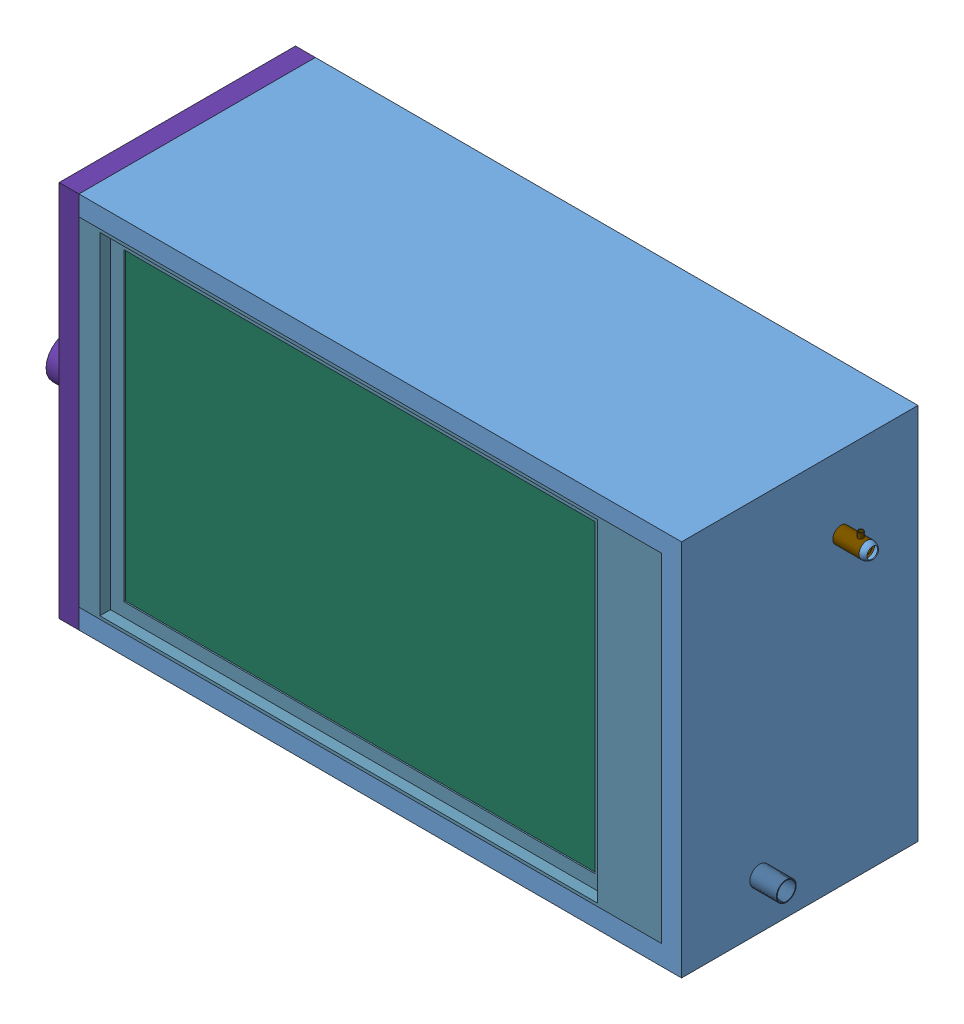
SolidWorks assembly evaporador.SLDASM, configuration Predeterminado (file format 4400). Lengths in mm.
Overall size (1320.42 723 452.5).
255 component instances, 19 part files, 44 mates.
Components (placement in the parent):
- carcasa parte enrada y salida de refrigerante-1: carcasa parte enrada y salida de refrigerante.SLDPRT [Predeterminado] at (-563.5445 -272.3645 -226.25) size (1153.5 723 452.5)
- soporte intercambiador-1: soporte intercambiador.SLDPRT [Predeterminado] at (-524.0445 -196.3645 100.2125) x (0 0 -1) z (1 0 0) size (202.5 38 1114)
- emsamble evaporador-1: emsamble evaporador.SLDASM [Predeterminado] at (-11.8465 -71.5019 257.8938) x (0 0 -1) z (1 0 0) size (185.79 568.45 1168.05)
  - tubos arreglo evaporador-1: tubos arreglo evaporador.SLDPRT [Predeterminado] at (336.7188 419.7134 451.027) size (165.1 555.62 930.27)
  - union arreglo evaporador-1: union arreglo evaporador.SLDPRT [Predeterminado] at (336.7188 419.7134 -437.973) x (0.868243 -0.496139 0) z (0 0 1) size (35.12 9.53 14.76)
  - soporte evaporador serpentin-1: soporte evaporador serpentin.SLDPRT [Predeterminado] at (169.9313 443.5894 -477.248) x (1 0 0) z (0 -1 0) size (178 41.27 568.45)
  - union arreglo evaporador-5: union arreglo evaporador.SLDPRT [Predeterminado] at (336.7188 394.3134 -437.973) x (0.868243 -0.496139 0) z (0 0 1) size (35.12 9.53 14.76)
  - union arreglo evaporador-6: union arreglo evaporador.SLDPRT [Predeterminado] at (336.7188 368.9134 -437.973) x (0.868243 -0.496139 0) z (0 0 1) size (35.12 9.53 14.76)
  - union arreglo evaporador-7: union arreglo evaporador.SLDPRT [Predeterminado] at (336.7188 343.5134 -437.973) x (0.868243 -0.496139 0) z (0 0 1) size (35.12 9.53 14.76)
  - union arreglo evaporador-8: union arreglo evaporador.SLDPRT [Predeterminado] at (336.7188 318.1134 -437.973) x (0.868243 -0.496139 0) z (0 0 1) size (35.12 9.53 14.76)
  - union arreglo evaporador-9: union arreglo evaporador.SLDPRT [Predeterminado] at (336.7188 292.7134 -437.973) x (0.868243 -0.496139 0) z (0 0 1) size (35.12 9.53 14.76)
  - union arreglo evaporador-10: union arreglo evaporador.SLDPRT [Predeterminado] at (336.7188 267.3134 -437.973) x (0.868243 -0.496139 0) z (0 0 1) size (35.12 9.53 14.76)
  - union arreglo evaporador-11: union arreglo evaporador.SLDPRT [Predeterminado] at (336.7188 241.9134 -437.973) x (0.868243 -0.496139 0) z (0 0 1) size (35.12 9.53 14.76)
  - union arreglo evaporador-12: union arreglo evaporador.SLDPRT [Predeterminado] at (336.7188 216.5134 -437.973) x (0.868243 -0.496139 0) z (0 0 1) size (35.12 9.53 14.76)
  - union arreglo evaporador-13: union arreglo evaporador.SLDPRT [Predeterminado] at (336.7188 191.1134 -437.973) x (0.868243 -0.496139 0) z (0 0 1) size (35.12 9.53 14.76)
  - union arreglo evaporador-14: union arreglo evaporador.SLDPRT [Predeterminado] at (336.7188 165.7134 -437.973) x (0.868243 -0.496139 0) z (0 0 1) size (35.12 9.53 14.76)
  - union arreglo evaporador-15: union arreglo evaporador.SLDPRT [Predeterminado] at (336.7188 140.3134 -437.973) x (0.868243 -0.496139 0) z (0 0 1) size (35.12 9.53 14.76)
  - union arreglo evaporador-16: union arreglo evaporador.SLDPRT [Predeterminado] at (336.7188 114.9134 -437.973) x (0.868243 -0.496139 0) z (0 0 1) size (35.12 9.53 14.76)
  - union arreglo evaporador-17: union arreglo evaporador.SLDPRT [Predeterminado] at (336.7188 89.5134 -437.973) x (0.868243 -0.496139 0) z (0 0 1) size (35.12 9.53 14.76)
  - union arreglo evaporador-18: union arreglo evaporador.SLDPRT [Predeterminado] at (336.7188 64.1134 -437.973) x (0.868243 -0.496139 0) z (0 0 1) size (35.12 9.53 14.76)
  - union arreglo evaporador-19: union arreglo evaporador.SLDPRT [Predeterminado] at (336.7188 38.7134 -437.973) x (0.868243 -0.496139 0) z (0 0 1) size (35.12 9.53 14.76)
  - union arreglo evaporador-20: union arreglo evaporador.SLDPRT [Predeterminado] at (336.7188 13.3134 -437.973) x (0.868243 -0.496139 0) z (0 0 1) size (35.12 9.53 14.76)
  - union arreglo evaporador-21: union arreglo evaporador.SLDPRT [Predeterminado] at (336.7188 -12.0866 -437.973) x (0.868243 -0.496139 0) z (0 0 1) size (35.12 9.53 14.76)
  - union arreglo evaporador-22: union arreglo evaporador.SLDPRT [Predeterminado] at (336.7188 -37.4866 -437.973) x (0.868243 -0.496139 0) z (0 0 1) size (35.12 9.53 14.76)
  - union arreglo evaporador-23: union arreglo evaporador.SLDPRT [Predeterminado] at (336.7188 -62.8866 -437.973) x (0.868243 -0.496139 0) z (0 0 1) size (35.12 9.53 14.76)
  - union arreglo evaporador-24: union arreglo evaporador.SLDPRT [Predeterminado] at (336.7188 -88.2866 -437.973) x (0.868243 -0.496139 0) z (0 0 1) size (35.12 9.53 14.76)
  - union arreglo evaporador-25: union arreglo evaporador.SLDPRT [Predeterminado] at (336.7188 -113.6866 -437.973) x (0.868243 -0.496139 0) z (0 0 1) size (35.12 9.53 14.76)
  - union arreglo evaporador-26: union arreglo evaporador.SLDPRT [Predeterminado] at (292.2688 419.7134 -437.973) x (0.868243 -0.496139 0) z (0 0 1) size (35.12 9.53 14.76)
  - union arreglo evaporador-27: union arreglo evaporador.SLDPRT [Predeterminado] at (292.2688 394.3134 -437.973) x (0.868243 -0.496139 0) z (0 0 1) size (35.12 9.53 14.76)
  - union arreglo evaporador-28: union arreglo evaporador.SLDPRT [Predeterminado] at (292.2688 368.9134 -437.973) x (0.868243 -0.496139 0) z (0 0 1) size (35.12 9.53 14.76)
  - union arreglo evaporador-29: union arreglo evaporador.SLDPRT [Predeterminado] at (292.2688 343.5134 -437.973) x (0.868243 -0.496139 0) z (0 0 1) size (35.12 9.53 14.76)
  - union arreglo evaporador-30: union arreglo evaporador.SLDPRT [Predeterminado] at (292.2688 318.1134 -437.973) x (0.868243 -0.496139 0) z (0 0 1) size (35.12 9.53 14.76)
  - union arreglo evaporador-31: union arreglo evaporador.SLDPRT [Predeterminado] at (292.2688 292.7134 -437.973) x (0.868243 -0.496139 0) z (0 0 1) size (35.12 9.53 14.76)
  - union arreglo evaporador-32: union arreglo evaporador.SLDPRT [Predeterminado] at (292.2688 267.3134 -437.973) x (0.868243 -0.496139 0) z (0 0 1) size (35.12 9.53 14.76)
  - union arreglo evaporador-33: union arreglo evaporador.SLDPRT [Predeterminado] at (292.2688 241.9134 -437.973) x (0.868243 -0.496139 0) z (0 0 1) size (35.12 9.53 14.76)
  - union arreglo evaporador-34: union arreglo evaporador.SLDPRT [Predeterminado] at (292.2688 216.5134 -437.973) x (0.868243 -0.496139 0) z (0 0 1) size (35.12 9.53 14.76)
  - union arreglo evaporador-35: union arreglo evaporador.SLDPRT [Predeterminado] at (292.2688 191.1134 -437.973) x (0.868243 -0.496139 0) z (0 0 1) size (35.12 9.53 14.76)
  - union arreglo evaporador-36: union arreglo evaporador.SLDPRT [Predeterminado] at (292.2688 165.7134 -437.973) x (0.868243 -0.496139 0) z (0 0 1) size (35.12 9.53 14.76)
  - union arreglo evaporador-37: union arreglo evaporador.SLDPRT [Predeterminado] at (292.2688 140.3134 -437.973) x (0.868243 -0.496139 0) z (0 0 1) size (35.12 9.53 14.76)
  - union arreglo evaporador-38: union arreglo evaporador.SLDPRT [Predeterminado] at (292.2688 114.9134 -437.973) x (0.868243 -0.496139 0) z (0 0 1) size (35.12 9.53 14.76)
  - union arreglo evaporador-39: union arreglo evaporador.SLDPRT [Predeterminado] at (292.2688 89.5134 -437.973) x (0.868243 -0.496139 0) z (0 0 1) size (35.12 9.53 14.76)
  - union arreglo evaporador-40: union arreglo evaporador.SLDPRT [Predeterminado] at (292.2688 64.1134 -437.973) x (0.868243 -0.496139 0) z (0 0 1) size (35.12 9.53 14.76)
  - union arreglo evaporador-41: union arreglo evaporador.SLDPRT [Predeterminado] at (292.2688 38.7134 -437.973) x (0.868243 -0.496139 0) z (0 0 1) size (35.12 9.53 14.76)
  - union arreglo evaporador-42: union arreglo evaporador.SLDPRT [Predeterminado] at (292.2688 13.3134 -437.973) x (0.868243 -0.496139 0) z (0 0 1) size (35.12 9.53 14.76)
  - union arreglo evaporador-43: union arreglo evaporador.SLDPRT [Predeterminado] at (292.2688 -12.0866 -437.973) x (0.868243 -0.496139 0) z (0 0 1) size (35.12 9.53 14.76)
  - union arreglo evaporador-44: union arreglo evaporador.SLDPRT [Predeterminado] at (292.2688 -37.4866 -437.973) x (0.868243 -0.496139 0) z (0 0 1) size (35.12 9.53 14.76)
  - union arreglo evaporador-45: union arreglo evaporador.SLDPRT [Predeterminado] at (292.2688 -62.8866 -437.973) x (0.868243 -0.496139 0) z (0 0 1) size (35.12 9.53 14.76)
  - union arreglo evaporador-46: union arreglo evaporador.SLDPRT [Predeterminado] at (292.2688 -88.2866 -437.973) x (0.868243 -0.496139 0) z (0 0 1) size (35.12 9.53 14.76)
  - union arreglo evaporador-47: union arreglo evaporador.SLDPRT [Predeterminado] at (292.2688 -113.6866 -437.973) x (0.868243 -0.496139 0) z (0 0 1) size (35.12 9.53 14.76)
  - union arreglo evaporador-48: union arreglo evaporador.SLDPRT [Predeterminado] at (247.8188 419.7134 -437.973) x (0.868243 -0.496139 0) z (0 0 1) size (35.12 9.53 14.76)
  - union arreglo evaporador-49: union arreglo evaporador.SLDPRT [Predeterminado] at (247.8188 394.3134 -437.973) x (0.868243 -0.496139 0) z (0 0 1) size (35.12 9.53 14.76)
  - union arreglo evaporador-50: union arreglo evaporador.SLDPRT [Predeterminado] at (247.8188 368.9134 -437.973) x (0.868243 -0.496139 0) z (0 0 1) size (35.12 9.53 14.76)
  - union arreglo evaporador-51: union arreglo evaporador.SLDPRT [Predeterminado] at (247.8188 343.5134 -437.973) x (0.868243 -0.496139 0) z (0 0 1) size (35.12 9.53 14.76)
  - union arreglo evaporador-52: union arreglo evaporador.SLDPRT [Predeterminado] at (247.8188 318.1134 -437.973) x (0.868243 -0.496139 0) z (0 0 1) size (35.12 9.53 14.76)
  - union arreglo evaporador-53: union arreglo evaporador.SLDPRT [Predeterminado] at (247.8188 292.7134 -437.973) x (0.868243 -0.496139 0) z (0 0 1) size (35.12 9.53 14.76)
  - union arreglo evaporador-54: union arreglo evaporador.SLDPRT [Predeterminado] at (247.8188 267.3134 -437.973) x (0.868243 -0.496139 0) z (0 0 1) size (35.12 9.53 14.76)
  - union arreglo evaporador-55: union arreglo evaporador.SLDPRT [Predeterminado] at (247.8188 241.9134 -437.973) x (0.868243 -0.496139 0) z (0 0 1) size (35.12 9.53 14.76)
  - union arreglo evaporador-56: union arreglo evaporador.SLDPRT [Predeterminado] at (247.8188 216.5134 -437.973) x (0.868243 -0.496139 0) z (0 0 1) size (35.12 9.53 14.76)
  - union arreglo evaporador-57: union arreglo evaporador.SLDPRT [Predeterminado] at (247.8188 191.1134 -437.973) x (0.868243 -0.496139 0) z (0 0 1) size (35.12 9.53 14.76)
  - union arreglo evaporador-58: union arreglo evaporador.SLDPRT [Predeterminado] at (247.8188 165.7134 -437.973) x (0.868243 -0.496139 0) z (0 0 1) size (35.12 9.53 14.76)
  - union arreglo evaporador-59: union arreglo evaporador.SLDPRT [Predeterminado] at (247.8188 140.3134 -437.973) x (0.868243 -0.496139 0) z (0 0 1) size (35.12 9.53 14.76)
  - union arreglo evaporador-60: union arreglo evaporador.SLDPRT [Predeterminado] at (247.8188 114.9134 -437.973) x (0.868243 -0.496139 0) z (0 0 1) size (35.12 9.53 14.76)
  - union arreglo evaporador-61: union arreglo evaporador.SLDPRT [Predeterminado] at (247.8188 89.5134 -437.973) x (0.868243 -0.496139 0) z (0 0 1) size (35.12 9.53 14.76)
  - union arreglo evaporador-62: union arreglo evaporador.SLDPRT [Predeterminado] at (247.8188 64.1134 -437.973) x (0.868243 -0.496139 0) z (0 0 1) size (35.12 9.53 14.76)
  - union arreglo evaporador-63: union arreglo evaporador.SLDPRT [Predeterminado] at (247.8188 38.7134 -437.973) x (0.868243 -0.496139 0) z (0 0 1) size (35.12 9.53 14.76)
  - union arreglo evaporador-64: union arreglo evaporador.SLDPRT [Predeterminado] at (247.8188 13.3134 -437.973) x (0.868243 -0.496139 0) z (0 0 1) size (35.12 9.53 14.76)
  - union arreglo evaporador-65: union arreglo evaporador.SLDPRT [Predeterminado] at (247.8188 -12.0866 -437.973) x (0.868243 -0.496139 0) z (0 0 1) size (35.12 9.53 14.76)
  - union arreglo evaporador-66: union arreglo evaporador.SLDPRT [Predeterminado] at (247.8188 -37.4866 -437.973) x (0.868243 -0.496139 0) z (0 0 1) size (35.12 9.53 14.76)
  - union arreglo evaporador-67: union arreglo evaporador.SLDPRT [Predeterminado] at (247.8188 -62.8866 -437.973) x (0.868243 -0.496139 0) z (0 0 1) size (35.12 9.53 14.76)
  - union arreglo evaporador-68: union arreglo evaporador.SLDPRT [Predeterminado] at (247.8188 -88.2866 -437.973) x (0.868243 -0.496139 0) z (0 0 1) size (35.12 9.53 14.76)
  - union arreglo evaporador-69: union arreglo evaporador.SLDPRT [Predeterminado] at (247.8188 -113.6866 -437.973) x (0.868243 -0.496139 0) z (0 0 1) size (35.12 9.53 14.76)
  - union arreglo evaporador-70: union arreglo evaporador.SLDPRT [Predeterminado] at (203.3688 419.7134 -437.973) x (0.868243 -0.496139 0) z (0 0 1) size (35.12 9.53 14.76)
  - union arreglo evaporador-71: union arreglo evaporador.SLDPRT [Predeterminado] at (203.3688 394.3134 -437.973) x (0.868243 -0.496139 0) z (0 0 1) size (35.12 9.53 14.76)
  - union arreglo evaporador-72: union arreglo evaporador.SLDPRT [Predeterminado] at (203.3688 368.9134 -437.973) x (0.868243 -0.496139 0) z (0 0 1) size (35.12 9.53 14.76)
  - union arreglo evaporador-73: union arreglo evaporador.SLDPRT [Predeterminado] at (203.3688 343.5134 -437.973) x (0.868243 -0.496139 0) z (0 0 1) size (35.12 9.53 14.76)
  - union arreglo evaporador-74: union arreglo evaporador.SLDPRT [Predeterminado] at (203.3688 318.1134 -437.973) x (0.868243 -0.496139 0) z (0 0 1) size (35.12 9.53 14.76)
  - union arreglo evaporador-75: union arreglo evaporador.SLDPRT [Predeterminado] at (203.3688 292.7134 -437.973) x (0.868243 -0.496139 0) z (0 0 1) size (35.12 9.53 14.76)
  - union arreglo evaporador-76: union arreglo evaporador.SLDPRT [Predeterminado] at (203.3688 267.3134 -437.973) x (0.868243 -0.496139 0) z (0 0 1) size (35.12 9.53 14.76)
  - union arreglo evaporador-77: union arreglo evaporador.SLDPRT [Predeterminado] at (203.3688 241.9134 -437.973) x (0.868243 -0.496139 0) z (0 0 1) size (35.12 9.53 14.76)
  - union arreglo evaporador-78: union arreglo evaporador.SLDPRT [Predeterminado] at (203.3688 216.5134 -437.973) x (0.868243 -0.496139 0) z (0 0 1) size (35.12 9.53 14.76)
  - union arreglo evaporador-79: union arreglo evaporador.SLDPRT [Predeterminado] at (203.3688 191.1134 -437.973) x (0.868243 -0.496139 0) z (0 0 1) size (35.12 9.53 14.76)
  - union arreglo evaporador-80: union arreglo evaporador.SLDPRT [Predeterminado] at (203.3688 165.7134 -437.973) x (0.868243 -0.496139 0) z (0 0 1) size (35.12 9.53 14.76)
  - union arreglo evaporador-81: union arreglo evaporador.SLDPRT [Predeterminado] at (203.3688 140.3134 -437.973) x (0.868243 -0.496139 0) z (0 0 1) size (35.12 9.53 14.76)
  - union arreglo evaporador-82: union arreglo evaporador.SLDPRT [Predeterminado] at (203.3688 114.9134 -437.973) x (0.868243 -0.496139 0) z (0 0 1) size (35.12 9.53 14.76)
  - union arreglo evaporador-83: union arreglo evaporador.SLDPRT [Predeterminado] at (203.3688 89.5134 -437.973) x (0.868243 -0.496139 0) z (0 0 1) size (35.12 9.53 14.76)
  - union arreglo evaporador-84: union arreglo evaporador.SLDPRT [Predeterminado] at (203.3688 64.1134 -437.973) x (0.868243 -0.496139 0) z (0 0 1) size (35.12 9.53 14.76)
  - union arreglo evaporador-85: union arreglo evaporador.SLDPRT [Predeterminado] at (203.3688 38.7134 -437.973) x (0.868243 -0.496139 0) z (0 0 1) size (35.12 9.53 14.76)
  - union arreglo evaporador-86: union arreglo evaporador.SLDPRT [Predeterminado] at (203.3688 13.3134 -437.973) x (0.868243 -0.496139 0) z (0 0 1) size (35.12 9.53 14.76)
  - union arreglo evaporador-87: union arreglo evaporador.SLDPRT [Predeterminado] at (203.3688 -12.0866 -437.973) x (0.868243 -0.496139 0) z (0 0 1) size (35.12 9.53 14.76)
  - union arreglo evaporador-88: union arreglo evaporador.SLDPRT [Predeterminado] at (203.3688 -37.4866 -437.973) x (0.868243 -0.496139 0) z (0 0 1) size (35.12 9.53 14.76)
  - union arreglo evaporador-89: union arreglo evaporador.SLDPRT [Predeterminado] at (203.3688 -62.8866 -437.973) x (0.868243 -0.496139 0) z (0 0 1) size (35.12 9.53 14.76)
  - union arreglo evaporador-90: union arreglo evaporador.SLDPRT [Predeterminado] at (203.3688 -88.2866 -437.973) x (0.868243 -0.496139 0) z (0 0 1) size (35.12 9.53 14.76)
  - union arreglo evaporador-91: union arreglo evaporador.SLDPRT [Predeterminado] at (203.3688 -113.6866 -437.973) x (0.868243 -0.496139 0) z (0 0 1) size (35.12 9.53 14.76)
  - union arreglo evaporador-92: union arreglo evaporador.SLDPRT [Predeterminado] at (314.4938 432.4134 451.027) x (0.868243 0.496139 0) z (0 0 -1) size (35.12 9.53 14.76)
  - aleta serpentin evaporador-1: aleta serpentin evaporador.SLDPRT [Predeterminado] at (172.1438 440.5894 -430.973) x (1 0 0) z (0 1 0) size (173.58 0.5 562.45)
  - soporte evaporador serpentin lado entrad y salida-1: soporte evaporador serpentin lado entrad y salida.SLDPRT [Predeterminado] at (169.9313 -124.8626 490.302) x (1 0 0) z (0 1 0) size (178 41.27 568.45)
  - union arreglo evaporador-93: union arreglo evaporador.SLDPRT [Predeterminado] at (314.4938 407.0134 451.027) x (0.868243 0.496139 0) z (0 0 -1) size (35.12 9.53 14.76)
  - union arreglo evaporador-94: union arreglo evaporador.SLDPRT [Predeterminado] at (314.4938 381.6134 451.027) x (0.868243 0.496139 0) z (0 0 -1) size (35.12 9.53 14.76)
  - union arreglo evaporador-95: union arreglo evaporador.SLDPRT [Predeterminado] at (314.4938 356.2134 451.027) x (0.868243 0.496139 0) z (0 0 -1) size (35.12 9.53 14.76)
  - union arreglo evaporador-96: union arreglo evaporador.SLDPRT [Predeterminado] at (314.4938 330.8134 451.027) x (0.868243 0.496139 0) z (0 0 -1) size (35.12 9.53 14.76)
  - union arreglo evaporador-97: union arreglo evaporador.SLDPRT [Predeterminado] at (314.4938 305.4134 451.027) x (0.868243 0.496139 0) z (0 0 -1) size (35.12 9.53 14.76)
  - union arreglo evaporador-98: union arreglo evaporador.SLDPRT [Predeterminado] at (314.4938 280.0134 451.027) x (0.868243 0.496139 0) z (0 0 -1) size (35.12 9.53 14.76)
  - union arreglo evaporador-99: union arreglo evaporador.SLDPRT [Predeterminado] at (314.4938 254.6134 451.027) x (0.868243 0.496139 0) z (0 0 -1) size (35.12 9.53 14.76)
  - union arreglo evaporador-100: union arreglo evaporador.SLDPRT [Predeterminado] at (314.4938 229.2134 451.027) x (0.868243 0.496139 0) z (0 0 -1) size (35.12 9.53 14.76)
  - union arreglo evaporador-101: union arreglo evaporador.SLDPRT [Predeterminado] at (314.4938 203.8134 451.027) x (0.868243 0.496139 0) z (0 0 -1) size (35.12 9.53 14.76)
  - union arreglo evaporador-102: union arreglo evaporador.SLDPRT [Predeterminado] at (314.4938 178.4134 451.027) x (0.868243 0.496139 0) z (0 0 -1) size (35.12 9.53 14.76)
  - union arreglo evaporador-103: union arreglo evaporador.SLDPRT [Predeterminado] at (314.4938 153.0134 451.027) x (0.868243 0.496139 0) z (0 0 -1) size (35.12 9.53 14.76)
  - union arreglo evaporador-104: union arreglo evaporador.SLDPRT [Predeterminado] at (314.4938 127.6134 451.027) x (0.868243 0.496139 0) z (0 0 -1) size (35.12 9.53 14.76)
  - union arreglo evaporador-105: union arreglo evaporador.SLDPRT [Predeterminado] at (314.4938 102.2134 451.027) x (0.868243 0.496139 0) z (0 0 -1) size (35.12 9.53 14.76)
  - union arreglo evaporador-106: union arreglo evaporador.SLDPRT [Predeterminado] at (314.4938 76.8134 451.027) x (0.868243 0.496139 0) z (0 0 -1) size (35.12 9.53 14.76)
  - union arreglo evaporador-107: union arreglo evaporador.SLDPRT [Predeterminado] at (314.4938 51.4134 451.027) x (0.868243 0.496139 0) z (0 0 -1) size (35.12 9.53 14.76)
  - union arreglo evaporador-108: union arreglo evaporador.SLDPRT [Predeterminado] at (314.4938 26.0134 451.027) x (0.868243 0.496139 0) z (0 0 -1) size (35.12 9.53 14.76)
  - union arreglo evaporador-109: union arreglo evaporador.SLDPRT [Predeterminado] at (314.4938 0.6134 451.027) x (0.868243 0.496139 0) z (0 0 -1) size (35.12 9.53 14.76)
  - union arreglo evaporador-110: union arreglo evaporador.SLDPRT [Predeterminado] at (314.4938 -24.7866 451.027) x (0.868243 0.496139 0) z (0 0 -1) size (35.12 9.53 14.76)
  - union arreglo evaporador-111: union arreglo evaporador.SLDPRT [Predeterminado] at (314.4938 -50.1866 451.027) x (0.868243 0.496139 0) z (0 0 -1) size (35.12 9.53 14.76)
  - union arreglo evaporador-112: union arreglo evaporador.SLDPRT [Predeterminado] at (314.4938 -75.5866 451.027) x (0.868243 0.496139 0) z (0 0 -1) size (35.12 9.53 14.76)
  - union arreglo evaporador-113: union arreglo evaporador.SLDPRT [Predeterminado] at (314.4938 -100.9866 451.027) x (0.868243 0.496139 0) z (0 0 -1) size (35.12 9.53 14.76)
  - union arreglo evaporador-114: union arreglo evaporador.SLDPRT [Predeterminado] at (270.0438 432.4134 451.027) x (0.868243 0.496139 0) z (0 0 -1) size (35.12 9.53 14.76)
  - union arreglo evaporador-115: union arreglo evaporador.SLDPRT [Predeterminado] at (270.0438 407.0134 451.027) x (0.868243 0.496139 0) z (0 0 -1) size (35.12 9.53 14.76)
  - union arreglo evaporador-116: union arreglo evaporador.SLDPRT [Predeterminado] at (270.0438 381.6134 451.027) x (0.868243 0.496139 0) z (0 0 -1) size (35.12 9.53 14.76)
  - union arreglo evaporador-117: union arreglo evaporador.SLDPRT [Predeterminado] at (270.0438 356.2134 451.027) x (0.868243 0.496139 0) z (0 0 -1) size (35.12 9.53 14.76)
  - union arreglo evaporador-118: union arreglo evaporador.SLDPRT [Predeterminado] at (270.0438 330.8134 451.027) x (0.868243 0.496139 0) z (0 0 -1) size (35.12 9.53 14.76)
  - union arreglo evaporador-119: union arreglo evaporador.SLDPRT [Predeterminado] at (270.0438 305.4134 451.027) x (0.868243 0.496139 0) z (0 0 -1) size (35.12 9.53 14.76)
  - union arreglo evaporador-120: union arreglo evaporador.SLDPRT [Predeterminado] at (270.0438 280.0134 451.027) x (0.868243 0.496139 0) z (0 0 -1) size (35.12 9.53 14.76)
  - union arreglo evaporador-121: union arreglo evaporador.SLDPRT [Predeterminado] at (270.0438 254.6134 451.027) x (0.868243 0.496139 0) z (0 0 -1) size (35.12 9.53 14.76)
  - union arreglo evaporador-122: union arreglo evaporador.SLDPRT [Predeterminado] at (270.0438 229.2134 451.027) x (0.868243 0.496139 0) z (0 0 -1) size (35.12 9.53 14.76)
  - union arreglo evaporador-123: union arreglo evaporador.SLDPRT [Predeterminado] at (270.0438 203.8134 451.027) x (0.868243 0.496139 0) z (0 0 -1) size (35.12 9.53 14.76)
  - union arreglo evaporador-124: union arreglo evaporador.SLDPRT [Predeterminado] at (270.0438 178.4134 451.027) x (0.868243 0.496139 0) z (0 0 -1) size (35.12 9.53 14.76)
  - union arreglo evaporador-125: union arreglo evaporador.SLDPRT [Predeterminado] at (270.0438 153.0134 451.027) x (0.868243 0.496139 0) z (0 0 -1) size (35.12 9.53 14.76)
  - union arreglo evaporador-126: union arreglo evaporador.SLDPRT [Predeterminado] at (270.0438 127.6134 451.027) x (0.868243 0.496139 0) z (0 0 -1) size (35.12 9.53 14.76)
  - union arreglo evaporador-127: union arreglo evaporador.SLDPRT [Predeterminado] at (270.0438 102.2134 451.027) x (0.868243 0.496139 0) z (0 0 -1) size (35.12 9.53 14.76)
  - union arreglo evaporador-128: union arreglo evaporador.SLDPRT [Predeterminado] at (270.0438 76.8134 451.027) x (0.868243 0.496139 0) z (0 0 -1) size (35.12 9.53 14.76)
  - union arreglo evaporador-129: union arreglo evaporador.SLDPRT [Predeterminado] at (270.0438 51.4134 451.027) x (0.868243 0.496139 0) z (0 0 -1) size (35.12 9.53 14.76)
  - union arreglo evaporador-130: union arreglo evaporador.SLDPRT [Predeterminado] at (270.0438 26.0134 451.027) x (0.868243 0.496139 0) z (0 0 -1) size (35.12 9.53 14.76)
  - union arreglo evaporador-131: union arreglo evaporador.SLDPRT [Predeterminado] at (270.0438 0.6134 451.027) x (0.868243 0.496139 0) z (0 0 -1) size (35.12 9.53 14.76)
  - union arreglo evaporador-132: union arreglo evaporador.SLDPRT [Predeterminado] at (270.0438 -24.7866 451.027) x (0.868243 0.496139 0) z (0 0 -1) size (35.12 9.53 14.76)
  - union arreglo evaporador-133: union arreglo evaporador.SLDPRT [Predeterminado] at (270.0438 -50.1866 451.027) x (0.868243 0.496139 0) z (0 0 -1) size (35.12 9.53 14.76)
  - union arreglo evaporador-134: union arreglo evaporador.SLDPRT [Predeterminado] at (270.0438 -75.5866 451.027) x (0.868243 0.496139 0) z (0 0 -1) size (35.12 9.53 14.76)
  - union arreglo evaporador-135: union arreglo evaporador.SLDPRT [Predeterminado] at (270.0438 -100.9866 451.027) x (0.868243 0.496139 0) z (0 0 -1) size (35.12 9.53 14.76)
  - union arreglo evaporador-136: union arreglo evaporador.SLDPRT [Predeterminado] at (225.5938 432.4134 451.027) x (0.868243 0.496139 0) z (0 0 -1) size (35.12 9.53 14.76)
  - union arreglo evaporador-137: union arreglo evaporador.SLDPRT [Predeterminado] at (225.5938 407.0134 451.027) x (0.868243 0.496139 0) z (0 0 -1) size (35.12 9.53 14.76)
  - union arreglo evaporador-138: union arreglo evaporador.SLDPRT [Predeterminado] at (225.5938 381.6134 451.027) x (0.868243 0.496139 0) z (0 0 -1) size (35.12 9.53 14.76)
  - union arreglo evaporador-139: union arreglo evaporador.SLDPRT [Predeterminado] at (225.5938 356.2134 451.027) x (0.868243 0.496139 0) z (0 0 -1) size (35.12 9.53 14.76)
  - union arreglo evaporador-140: union arreglo evaporador.SLDPRT [Predeterminado] at (225.5938 330.8134 451.027) x (0.868243 0.496139 0) z (0 0 -1) size (35.12 9.53 14.76)
  - union arreglo evaporador-141: union arreglo evaporador.SLDPRT [Predeterminado] at (225.5938 305.4134 451.027) x (0.868243 0.496139 0) z (0 0 -1) size (35.12 9.53 14.76)
  - union arreglo evaporador-142: union arreglo evaporador.SLDPRT [Predeterminado] at (225.5938 280.0134 451.027) x (0.868243 0.496139 0) z (0 0 -1) size (35.12 9.53 14.76)
  - union arreglo evaporador-143: union arreglo evaporador.SLDPRT [Predeterminado] at (225.5938 254.6134 451.027) x (0.868243 0.496139 0) z (0 0 -1) size (35.12 9.53 14.76)
  - union arreglo evaporador-144: union arreglo evaporador.SLDPRT [Predeterminado] at (225.5938 229.2134 451.027) x (0.868243 0.496139 0) z (0 0 -1) size (35.12 9.53 14.76)
  - union arreglo evaporador-145: union arreglo evaporador.SLDPRT [Predeterminado] at (225.5938 203.8134 451.027) x (0.868243 0.496139 0) z (0 0 -1) size (35.12 9.53 14.76)
  - union arreglo evaporador-146: union arreglo evaporador.SLDPRT [Predeterminado] at (225.5938 178.4134 451.027) x (0.868243 0.496139 0) z (0 0 -1) size (35.12 9.53 14.76)
  - union arreglo evaporador-147: union arreglo evaporador.SLDPRT [Predeterminado] at (225.5938 153.0134 451.027) x (0.868243 0.496139 0) z (0 0 -1) size (35.12 9.53 14.76)
  - union arreglo evaporador-148: union arreglo evaporador.SLDPRT [Predeterminado] at (225.5938 127.6134 451.027) x (0.868243 0.496139 0) z (0 0 -1) size (35.12 9.53 14.76)
  - union arreglo evaporador-149: union arreglo evaporador.SLDPRT [Predeterminado] at (225.5938 102.2134 451.027) x (0.868243 0.496139 0) z (0 0 -1) size (35.12 9.53 14.76)
  - union arreglo evaporador-150: union arreglo evaporador.SLDPRT [Predeterminado] at (225.5938 76.8134 451.027) x (0.868243 0.496139 0) z (0 0 -1) size (35.12 9.53 14.76)
  - union arreglo evaporador-151: union arreglo evaporador.SLDPRT [Predeterminado] at (225.5938 51.4134 451.027) x (0.868243 0.496139 0) z (0 0 -1) size (35.12 9.53 14.76)
  - union arreglo evaporador-152: union arreglo evaporador.SLDPRT [Predeterminado] at (225.5938 26.0134 451.027) x (0.868243 0.496139 0) z (0 0 -1) size (35.12 9.53 14.76)
  - union arreglo evaporador-153: union arreglo evaporador.SLDPRT [Predeterminado] at (225.5938 0.6134 451.027) x (0.868243 0.496139 0) z (0 0 -1) size (35.12 9.53 14.76)
  - union arreglo evaporador-154: union arreglo evaporador.SLDPRT [Predeterminado] at (225.5938 -24.7866 451.027) x (0.868243 0.496139 0) z (0 0 -1) size (35.12 9.53 14.76)
  - union arreglo evaporador-155: union arreglo evaporador.SLDPRT [Predeterminado] at (225.5938 -50.1866 451.027) x (0.868243 0.496139 0) z (0 0 -1) size (35.12 9.53 14.76)
  - union arreglo evaporador-156: union arreglo evaporador.SLDPRT [Predeterminado] at (225.5938 -75.5866 451.027) x (0.868243 0.496139 0) z (0 0 -1) size (35.12 9.53 14.76)
  - union arreglo evaporador-157: union arreglo evaporador.SLDPRT [Predeterminado] at (225.5938 -100.9866 451.027) x (0.868243 0.496139 0) z (0 0 -1) size (35.12 9.53 14.76)
  - aleta serpentin evaporador-2: aleta serpentin evaporador.SLDPRT [Predeterminado] at (172.1438 440.5894 -418.973) x (1 0 0) z (0 1 0) size (173.58 0.5 562.45) (hidden)
  - aleta serpentin evaporador-3: aleta serpentin evaporador.SLDPRT [Predeterminado] at (172.1438 440.5894 -406.973) x (1 0 0) z (0 1 0) size (173.58 0.5 562.45) (hidden)
  - aleta serpentin evaporador-4: aleta serpentin evaporador.SLDPRT [Predeterminado] at (172.1438 440.5894 -394.973) x (1 0 0) z (0 1 0) size (173.58 0.5 562.45) (hidden)
  - aleta serpentin evaporador-5: aleta serpentin evaporador.SLDPRT [Predeterminado] at (172.1438 440.5894 -382.973) x (1 0 0) z (0 1 0) size (173.58 0.5 562.45) (hidden)
  - aleta serpentin evaporador-6: aleta serpentin evaporador.SLDPRT [Predeterminado] at (172.1438 440.5894 -370.973) x (1 0 0) z (0 1 0) size (173.58 0.5 562.45) (hidden)
  - aleta serpentin evaporador-7: aleta serpentin evaporador.SLDPRT [Predeterminado] at (172.1438 440.5894 -358.973) x (1 0 0) z (0 1 0) size (173.58 0.5 562.45) (hidden)
  - aleta serpentin evaporador-8: aleta serpentin evaporador.SLDPRT [Predeterminado] at (172.1438 440.5894 -346.973) x (1 0 0) z (0 1 0) size (173.58 0.5 562.45) (hidden)
  - aleta serpentin evaporador-9: aleta serpentin evaporador.SLDPRT [Predeterminado] at (172.1438 440.5894 -334.973) x (1 0 0) z (0 1 0) size (173.58 0.5 562.45) (hidden)
  - aleta serpentin evaporador-10: aleta serpentin evaporador.SLDPRT [Predeterminado] at (172.1438 440.5894 -322.973) x (1 0 0) z (0 1 0) size (173.58 0.5 562.45) (hidden)
  - aleta serpentin evaporador-11: aleta serpentin evaporador.SLDPRT [Predeterminado] at (172.1438 440.5894 -310.973) x (1 0 0) z (0 1 0) size (173.58 0.5 562.45) (hidden)
  - aleta serpentin evaporador-12: aleta serpentin evaporador.SLDPRT [Predeterminado] at (172.1438 440.5894 -298.973) x (1 0 0) z (0 1 0) size (173.58 0.5 562.45) (hidden)
  - aleta serpentin evaporador-13: aleta serpentin evaporador.SLDPRT [Predeterminado] at (172.1438 440.5894 -286.973) x (1 0 0) z (0 1 0) size (173.58 0.5 562.45) (hidden)
  - aleta serpentin evaporador-14: aleta serpentin evaporador.SLDPRT [Predeterminado] at (172.1438 440.5894 -274.973) x (1 0 0) z (0 1 0) size (173.58 0.5 562.45) (hidden)
  - aleta serpentin evaporador-15: aleta serpentin evaporador.SLDPRT [Predeterminado] at (172.1438 440.5894 -262.973) x (1 0 0) z (0 1 0) size (173.58 0.5 562.45) (hidden)
  - aleta serpentin evaporador-16: aleta serpentin evaporador.SLDPRT [Predeterminado] at (172.1438 440.5894 -250.973) x (1 0 0) z (0 1 0) size (173.58 0.5 562.45) (hidden)
  - aleta serpentin evaporador-17: aleta serpentin evaporador.SLDPRT [Predeterminado] at (172.1438 440.5894 -238.973) x (1 0 0) z (0 1 0) size (173.58 0.5 562.45) (hidden)
  - aleta serpentin evaporador-18: aleta serpentin evaporador.SLDPRT [Predeterminado] at (172.1438 440.5894 -226.973) x (1 0 0) z (0 1 0) size (173.58 0.5 562.45) (hidden)
  - aleta serpentin evaporador-19: aleta serpentin evaporador.SLDPRT [Predeterminado] at (172.1438 440.5894 -214.973) x (1 0 0) z (0 1 0) size (173.58 0.5 562.45) (hidden)
  - aleta serpentin evaporador-20: aleta serpentin evaporador.SLDPRT [Predeterminado] at (172.1438 440.5894 -202.973) x (1 0 0) z (0 1 0) size (173.58 0.5 562.45) (hidden)
  - aleta serpentin evaporador-21: aleta serpentin evaporador.SLDPRT [Predeterminado] at (172.1438 440.5894 -190.973) x (1 0 0) z (0 1 0) size (173.58 0.5 562.45) (hidden)
  - aleta serpentin evaporador-22: aleta serpentin evaporador.SLDPRT [Predeterminado] at (172.1438 440.5894 -178.973) x (1 0 0) z (0 1 0) size (173.58 0.5 562.45) (hidden)
  - aleta serpentin evaporador-23: aleta serpentin evaporador.SLDPRT [Predeterminado] at (172.1438 440.5894 -166.973) x (1 0 0) z (0 1 0) size (173.58 0.5 562.45) (hidden)
  - aleta serpentin evaporador-24: aleta serpentin evaporador.SLDPRT [Predeterminado] at (172.1438 440.5894 -154.973) x (1 0 0) z (0 1 0) size (173.58 0.5 562.45) (hidden)
  - aleta serpentin evaporador-25: aleta serpentin evaporador.SLDPRT [Predeterminado] at (172.1438 440.5894 -142.973) x (1 0 0) z (0 1 0) size (173.58 0.5 562.45) (hidden)
  - aleta serpentin evaporador-26: aleta serpentin evaporador.SLDPRT [Predeterminado] at (172.1438 440.5894 -130.973) x (1 0 0) z (0 1 0) size (173.58 0.5 562.45) (hidden)
  - aleta serpentin evaporador-27: aleta serpentin evaporador.SLDPRT [Predeterminado] at (172.1438 440.5894 -118.973) x (1 0 0) z (0 1 0) size (173.58 0.5 562.45) (hidden)
  - aleta serpentin evaporador-28: aleta serpentin evaporador.SLDPRT [Predeterminado] at (172.1438 440.5894 -106.973) x (1 0 0) z (0 1 0) size (173.58 0.5 562.45) (hidden)
  - aleta serpentin evaporador-29: aleta serpentin evaporador.SLDPRT [Predeterminado] at (172.1438 440.5894 -94.973) x (1 0 0) z (0 1 0) size (173.58 0.5 562.45) (hidden)
  - aleta serpentin evaporador-30: aleta serpentin evaporador.SLDPRT [Predeterminado] at (172.1438 440.5894 -82.973) x (1 0 0) z (0 1 0) size (173.58 0.5 562.45) (hidden)
  - aleta serpentin evaporador-31: aleta serpentin evaporador.SLDPRT [Predeterminado] at (172.1438 440.5894 -70.973) x (1 0 0) z (0 1 0) size (173.58 0.5 562.45) (hidden)
  - aleta serpentin evaporador-32: aleta serpentin evaporador.SLDPRT [Predeterminado] at (172.1438 440.5894 -58.973) x (1 0 0) z (0 1 0) size (173.58 0.5 562.45) (hidden)
  - aleta serpentin evaporador-33: aleta serpentin evaporador.SLDPRT [Predeterminado] at (172.1438 440.5894 -46.973) x (1 0 0) z (0 1 0) size (173.58 0.5 562.45) (hidden)
  - aleta serpentin evaporador-34: aleta serpentin evaporador.SLDPRT [Predeterminado] at (172.1438 440.5894 -34.973) x (1 0 0) z (0 1 0) size (173.58 0.5 562.45) (hidden)
  - aleta serpentin evaporador-35: aleta serpentin evaporador.SLDPRT [Predeterminado] at (172.1438 440.5894 -22.973) x (1 0 0) z (0 1 0) size (173.58 0.5 562.45) (hidden)
  - aleta serpentin evaporador-36: aleta serpentin evaporador.SLDPRT [Predeterminado] at (172.1438 440.5894 -10.973) x (1 0 0) z (0 1 0) size (173.58 0.5 562.45) (hidden)
  - aleta serpentin evaporador-37: aleta serpentin evaporador.SLDPRT [Predeterminado] at (172.1438 440.5894 1.027) x (1 0 0) z (0 1 0) size (173.58 0.5 562.45) (hidden)
  - aleta serpentin evaporador-38: aleta serpentin evaporador.SLDPRT [Predeterminado] at (172.1438 440.5894 13.027) x (1 0 0) z (0 1 0) size (173.58 0.5 562.45) (hidden)
  - aleta serpentin evaporador-39: aleta serpentin evaporador.SLDPRT [Predeterminado] at (172.1438 440.5894 25.027) x (1 0 0) z (0 1 0) size (173.58 0.5 562.45) (hidden)
  - aleta serpentin evaporador-40: aleta serpentin evaporador.SLDPRT [Predeterminado] at (172.1438 440.5894 37.027) x (1 0 0) z (0 1 0) size (173.58 0.5 562.45) (hidden)
  - aleta serpentin evaporador-41: aleta serpentin evaporador.SLDPRT [Predeterminado] at (172.1438 440.5894 49.027) x (1 0 0) z (0 1 0) size (173.58 0.5 562.45) (hidden)
  - aleta serpentin evaporador-42: aleta serpentin evaporador.SLDPRT [Predeterminado] at (172.1438 440.5894 61.027) x (1 0 0) z (0 1 0) size (173.58 0.5 562.45) (hidden)
  - aleta serpentin evaporador-43: aleta serpentin evaporador.SLDPRT [Predeterminado] at (172.1438 440.5894 73.027) x (1 0 0) z (0 1 0) size (173.58 0.5 562.45) (hidden)
  - aleta serpentin evaporador-44: aleta serpentin evaporador.SLDPRT [Predeterminado] at (172.1438 440.5894 85.027) x (1 0 0) z (0 1 0) size (173.58 0.5 562.45) (hidden)
  - aleta serpentin evaporador-45: aleta serpentin evaporador.SLDPRT [Predeterminado] at (172.1438 440.5894 97.027) x (1 0 0) z (0 1 0) size (173.58 0.5 562.45) (hidden)
  - aleta serpentin evaporador-46: aleta serpentin evaporador.SLDPRT [Predeterminado] at (172.1438 440.5894 109.027) x (1 0 0) z (0 1 0) size (173.58 0.5 562.45) (hidden)
  - aleta serpentin evaporador-47: aleta serpentin evaporador.SLDPRT [Predeterminado] at (172.1438 440.5894 121.027) x (1 0 0) z (0 1 0) size (173.58 0.5 562.45) (hidden)
  - aleta serpentin evaporador-48: aleta serpentin evaporador.SLDPRT [Predeterminado] at (172.1438 440.5894 133.027) x (1 0 0) z (0 1 0) size (173.58 0.5 562.45) (hidden)
  - aleta serpentin evaporador-49: aleta serpentin evaporador.SLDPRT [Predeterminado] at (172.1438 440.5894 145.027) x (1 0 0) z (0 1 0) size (173.58 0.5 562.45) (hidden)
  - aleta serpentin evaporador-50: aleta serpentin evaporador.SLDPRT [Predeterminado] at (172.1438 440.5894 157.027) x (1 0 0) z (0 1 0) size (173.58 0.5 562.45) (hidden)
  - aleta serpentin evaporador-51: aleta serpentin evaporador.SLDPRT [Predeterminado] at (172.1438 440.5894 169.027) x (1 0 0) z (0 1 0) size (173.58 0.5 562.45) (hidden)
  - aleta serpentin evaporador-52: aleta serpentin evaporador.SLDPRT [Predeterminado] at (172.1438 440.5894 181.027) x (1 0 0) z (0 1 0) size (173.58 0.5 562.45) (hidden)
  - aleta serpentin evaporador-53: aleta serpentin evaporador.SLDPRT [Predeterminado] at (172.1438 440.5894 193.027) x (1 0 0) z (0 1 0) size (173.58 0.5 562.45) (hidden)
  - aleta serpentin evaporador-54: aleta serpentin evaporador.SLDPRT [Predeterminado] at (172.1438 440.5894 205.027) x (1 0 0) z (0 1 0) size (173.58 0.5 562.45) (hidden)
  - aleta serpentin evaporador-55: aleta serpentin evaporador.SLDPRT [Predeterminado] at (172.1438 440.5894 217.027) x (1 0 0) z (0 1 0) size (173.58 0.5 562.45) (hidden)
  - aleta serpentin evaporador-56: aleta serpentin evaporador.SLDPRT [Predeterminado] at (172.1438 440.5894 229.027) x (1 0 0) z (0 1 0) size (173.58 0.5 562.45) (hidden)
  - aleta serpentin evaporador-57: aleta serpentin evaporador.SLDPRT [Predeterminado] at (172.1438 440.5894 241.027) x (1 0 0) z (0 1 0) size (173.58 0.5 562.45) (hidden)
  - aleta serpentin evaporador-58: aleta serpentin evaporador.SLDPRT [Predeterminado] at (172.1438 440.5894 253.027) x (1 0 0) z (0 1 0) size (173.58 0.5 562.45) (hidden)
  - aleta serpentin evaporador-59: aleta serpentin evaporador.SLDPRT [Predeterminado] at (172.1438 440.5894 265.027) x (1 0 0) z (0 1 0) size (173.58 0.5 562.45) (hidden)
  - aleta serpentin evaporador-60: aleta serpentin evaporador.SLDPRT [Predeterminado] at (172.1438 440.5894 277.027) x (1 0 0) z (0 1 0) size (173.58 0.5 562.45) (hidden)
  - aleta serpentin evaporador-61: aleta serpentin evaporador.SLDPRT [Predeterminado] at (172.1438 440.5894 289.027) x (1 0 0) z (0 1 0) size (173.58 0.5 562.45) (hidden)
  - aleta serpentin evaporador-62: aleta serpentin evaporador.SLDPRT [Predeterminado] at (172.1438 440.5894 301.027) x (1 0 0) z (0 1 0) size (173.58 0.5 562.45) (hidden)
  - aleta serpentin evaporador-63: aleta serpentin evaporador.SLDPRT [Predeterminado] at (172.1438 440.5894 313.027) x (1 0 0) z (0 1 0) size (173.58 0.5 562.45) (hidden)
  - aleta serpentin evaporador-64: aleta serpentin evaporador.SLDPRT [Predeterminado] at (172.1438 440.5894 325.027) x (1 0 0) z (0 1 0) size (173.58 0.5 562.45) (hidden)
  - aleta serpentin evaporador-65: aleta serpentin evaporador.SLDPRT [Predeterminado] at (172.1438 440.5894 337.027) x (1 0 0) z (0 1 0) size (173.58 0.5 562.45) (hidden)
  - aleta serpentin evaporador-66: aleta serpentin evaporador.SLDPRT [Predeterminado] at (172.1438 440.5894 349.027) x (1 0 0) z (0 1 0) size (173.58 0.5 562.45) (hidden)
  - aleta serpentin evaporador-67: aleta serpentin evaporador.SLDPRT [Predeterminado] at (172.1438 440.5894 361.027) x (1 0 0) z (0 1 0) size (173.58 0.5 562.45) (hidden)
  - aleta serpentin evaporador-68: aleta serpentin evaporador.SLDPRT [Predeterminado] at (172.1438 440.5894 373.027) x (1 0 0) z (0 1 0) size (173.58 0.5 562.45) (hidden)
  - aleta serpentin evaporador-69: aleta serpentin evaporador.SLDPRT [Predeterminado] at (172.1438 440.5894 385.027) x (1 0 0) z (0 1 0) size (173.58 0.5 562.45) (hidden)
  - aleta serpentin evaporador-70: aleta serpentin evaporador.SLDPRT [Predeterminado] at (172.1438 440.5894 397.027) x (1 0 0) z (0 1 0) size (173.58 0.5 562.45) (hidden)
  - aleta serpentin evaporador-71: aleta serpentin evaporador.SLDPRT [Predeterminado] at (172.1438 440.5894 409.027) x (1 0 0) z (0 1 0) size (173.58 0.5 562.45) (hidden)
  - aleta serpentin evaporador-72: aleta serpentin evaporador.SLDPRT [Predeterminado] at (172.1438 440.5894 421.027) x (1 0 0) z (0 1 0) size (173.58 0.5 562.45) (hidden)
  - aleta serpentin evaporador-73: aleta serpentin evaporador.SLDPRT [Predeterminado] at (172.1438 440.5894 433.027) x (1 0 0) z (0 1 0) size (173.58 0.5 562.45) (hidden)
  - aleta serpentin evaporador-74: aleta serpentin evaporador.SLDPRT [Predeterminado] at (172.1438 440.5894 445.027) x (1 0 0) z (0 1 0) size (173.58 0.5 562.45) (hidden)
  - tubo multiple distribuidor de entrada-1: tubo multiple distribuidor de entrada.SLDPRT [Predeterminado] at (336.7188 439.5894 499.802) x (0 0 1) z (0 -1 0) size (79 18 560)
  - boquilla entrada refrigerante-1: boquilla entrada refrigerante.SLDPRT [Predeterminado] at (336.7188 381.5894 558.802) size (22 22 130)
  - tubo multiple de retorno-3: tubo multiple de retorno.SLDPRT [Predeterminado] at (181.1438 -105.8626 490.802) x (0 1 0) z (0 0 1) size (568.45 38 200)
- soporte intercambiador-2: soporte intercambiador.SLDPRT [Predeterminado] at (589.9555 372.0875 100.2125) x (0 0 -1) z (-1 0 0) size (202.5 38 1114)
- distribuidor glicol-1: distribuidor glicol.SLDPRT [Predeterminado] at (-481.8195 404.1355 -106.75) x (1 0 0) z (0 0 -1) size (1087 638.5 73)
- distribuidor glicol-2: distribuidor glicol.SLDPRT [Predeterminado] at (-481.8195 404.1355 179.75) x (1 0 0) z (0 0 -1) size (1087 638.5 73)
- empaque de caucho nopreno 1-8 de espesor-1: empaque de caucho nopreno 1-8 de espesor.SLDPRT [Predeterminado] at (-491.8195 -234.3645 -182.95) size (1077 647 3.2)
- empaque de caucho nopreno 1-8 de espesor-2: empaque de caucho nopreno 1-8 de espesor.SLDPRT [Predeterminado] at (-491.8195 -234.3645 179.75) size (1077 647 3.2)
- emsamble tapa vidrio-1: emsamble tapa vidrio.SLDASM [Predeterminado] at (-6.5255 148.722 -198.5) x (1 0 0) z (0 0 -1) size (1115.5 647 54.5)
  - separador de vidrio-1: separador de vidrio.SLDPRT [Predeterminado] at (-474.019 -255.4135 -1.75) size (947 638.5 3.5)
  - soporte vidrio-1: soporte vidrio.SLDPRT [Predeterminado] at (-557.019 -301.9135 4.75) size (1115.5 647 23)
  - vidrio delgado-1: vidrio delgado.SLDPRT [Predeterminado] at (-474.019 -255.4135 1.75) size (947 638.5 3)
  - vidrio grueso-1: vidrio grueso.SLDPRT [Predeterminado] at (-474.019 -255.4135 -26.75) size (947 638.5 25)
- emsamble tapa vidrio-2: emsamble tapa vidrio.SLDASM [Predeterminado] at (-6.5255 29.549 198.5) size (1115.5 647 54.5)
  - separador de vidrio-1: separador de vidrio.SLDPRT [Predeterminado] at (-474.019 -255.4135 -1.75) size (947 638.5 3.5)
  - soporte vidrio-1: soporte vidrio.SLDPRT [Predeterminado] at (-557.019 -301.9135 4.75) size (1115.5 647 23)
  - vidrio delgado-1: vidrio delgado.SLDPRT [Predeterminado] at (-474.019 -255.4135 1.75) size (947 638.5 3)
  - vidrio grueso-1: vidrio grueso.SLDPRT [Predeterminado] at (-474.019 -255.4135 -26.75) size (947 638.5 25)
- tapa carcasa-1: tapa carcasa.SLDPRT [Predeterminado] at (-563.5445 -272.3645 -226.25) size (106 723 452.5)
- boquilla entrada refrigerador carcasa parte1-2: boquilla entrada refrigerador carcasa parte1.SLDPRT [Predeterminado] at (677.9555 310.0875 -78.825) x (0 0 1) z (-1 0 0) size (31 40.5 50)
- boquilla entrada refrigerador carcasa parte2-2: boquilla entrada refrigerador carcasa parte2.SLDPRT [Predeterminado] at (677.9555 310.0875 -78.825) x (0 -1 0) z (0 0 1) size (31 10.92 31)
Mates (geometry in assembly coordinates):
- Paralelo1: parallel anti-aligned: plane of carcasa parte enrada y salida de refrigerante-1 through (-525.5445 -234.3645 226.25) normal (0 1 0); plane of soporte intercambiador-1 through (589.9555 -197.8645 -100.7875) normal (0 -1 0)
- Coincidente2: coincident anti-aligned: plane of carcasa parte enrada y salida de refrigerante-1 through (589.9555 -234.3645 226.25) normal (-1 0 0); plane of soporte intercambiador-1 through (589.9555 -234.3645 100.2125) normal (1 0 0)
- Coincidente3: coincident anti-aligned: plane of carcasa parte enrada y salida de refrigerante-1 through (-525.5445 -234.3645 226.25) normal (0 1 0); plane of soporte intercambiador-1 through (589.9555 -234.3645 100.2125) normal (0 -1 0)
- Coincidente4: coincident anti-aligned: plane of soporte intercambiador-1 through (589.9555 -196.3645 100.2125) normal (0 1 0); plane of emsamble evaporador-1/soporte evaporador serpentin lado entrad y salida-1 through (478.4555 -196.3645 85.9625) normal (0 -1 0)
- Paralelo2: parallel anti-aligned: plane of carcasa parte enrada y salida de refrigerante-1 through (589.9555 -234.3645 226.25) normal (-1 0 0); plane of emsamble evaporador-1/soporte evaporador serpentin lado entrad y salida-1 through (439.1805 372.0875 85.9625) normal (1 0 0)
- Distancia1: distance = 12.25 mm aligned: plane of soporte intercambiador-1 through (589.9555 -196.3645 100.2125) normal (0 0 1); plane of emsamble evaporador-1/soporte evaporador serpentin lado entrad y salida-1 through (478.4555 372.0875 87.9625) normal (0 0 1)
- Concéntrica1: concentric aligned: cylinder of carcasa parte enrada y salida de refrigerante-1 through (589.9555 -177.3645 76.75) axis (1 0 0) radius 19; cylinder of ? through (478.9555 -177.3645 76.75) axis (1 0 0) radius 19
- Distancia2: distance = 85 mm anti-aligned: cylinder of ? through (491.9555 372.0875 76.75) axis (0 -1 0) radius 13; plane of carcasa parte enrada y salida de refrigerante-1 through (589.9555 -234.3645 226.25) normal (-1 0 0)
- Paralelo3: parallel aligned: plane of carcasa parte enrada y salida de refrigerante-1 through (-525.5445 412.6355 226.25) normal (0 -1 0); plane of soporte intercambiador-2 through (-524.0445 372.0875 100.2125) normal (0 -1 0)
- Coincidente8: coincident anti-aligned: plane of carcasa parte enrada y salida de refrigerante-1 through (589.9555 -234.3645 226.25) normal (-1 0 0); plane of soporte intercambiador-2 through (589.9555 410.0875 100.2125) normal (1 0 0)
- Coincidente9: coincident anti-aligned: plane of emsamble evaporador-1/soporte evaporador serpentin-1 through (-489.0945 372.0875 85.9625) normal (0 1 0); plane of soporte intercambiador-2 through (-524.0445 372.0875 100.2125) normal (0 -1 0)
- Distancia3: distance = 12.25 mm aligned: plane of emsamble evaporador-1/soporte evaporador serpentin-1 through (-489.0945 -196.3645 87.9625) normal (0 0 1); plane of soporte intercambiador-2 through (-524.0445 372.0875 100.2125) normal (0 0 1)
- Paralelo4: parallel anti-aligned: plane of carcasa parte enrada y salida de refrigerante-1 through (-525.5445 -234.3645 226.25) normal (0 1 0); plane of distribuidor glicol-1 through (-481.8195 -234.3645 -179.75) normal (0 -1 0)
- Coincidente13: coincident aligned: plane of emsamble evaporador-1/soporte evaporador serpentin lado entrad y salida-1 through (437.1805 372.0875 87.9625) normal (-1 0 0); plane of distribuidor glicol-1 through (437.1805 -206.3645 -179.75) normal (-1 0 0)
- Coincidente14: coincident anti-aligned: plane of carcasa parte enrada y salida de refrigerante-1 through (-525.5445 -234.3645 226.25) normal (0 1 0); plane of distribuidor glicol-1 through (-481.8195 -234.3645 -179.75) normal (0 -1 0)
- Coincidente15: coincident anti-aligned: plane of carcasa parte enrada y salida de refrigerante-1 through (-525.5445 -234.3645 226.25) normal (0 1 0); plane of distribuidor glicol-2 through (-481.8195 -234.3645 106.75) normal (0 -1 0)
- Coincidente17: coincident aligned: plane of emsamble evaporador-1/soporte evaporador serpentin lado entrad y salida-1 through (437.1805 372.0875 87.9625) normal (-1 0 0); plane of distribuidor glicol-2 through (437.1805 -206.3645 106.75) normal (-1 0 0)
- Coincidente18: coincident anti-aligned: plane of distribuidor glicol-2 through (-481.8195 -234.3645 179.75) normal (0 0 1); plane of empaque de caucho nopreno 1-8 de espesor-2 through (-491.8195 412.6355 179.75) normal (0 0 -1)
- Coincidente19: coincident anti-aligned: plane of carcasa parte enrada y salida de refrigerante-1 through (-525.5445 -234.3645 226.25) normal (0 1 0); plane of empaque de caucho nopreno 1-8 de espesor-2 through (-491.8195 -234.3645 182.95) normal (0 -1 0)
- Coincidente21: coincident anti-aligned: plane of distribuidor glicol-1 through (-481.8195 -234.3645 -179.75) normal (0 0 -1); plane of empaque de caucho nopreno 1-8 de espesor-1 through (-491.8195 412.6355 -179.75) normal (0 0 1)
- Coincidente22: coincident anti-aligned: plane of carcasa parte enrada y salida de refrigerante-1 through (-525.5445 -234.3645 226.25) normal (0 1 0); plane of empaque de caucho nopreno 1-8 de espesor-1 through (-491.8195 -234.3645 -179.75) normal (0 -1 0)
- Paralelo5: parallel anti-aligned: plane of empaque de caucho nopreno 1-8 de espesor-1 through (-491.8195 412.6355 -182.95) normal (0 0 -1); plane of emsamble tapa vidrio-1/soporte vidrio-1 through (-563.5445 -272.3645 -203.25) normal (0 0 1)
- Coincidente25: coincident anti-aligned: plane of carcasa parte enrada y salida de refrigerante-1 through (-525.5445 -234.3645 226.25) normal (0 1 0); plane of emsamble tapa vidrio-1/soporte vidrio-1 through (627.9555 -234.3645 -223.59) normal (0 -1 0)
- Coincidente26: coincident aligned: plane of carcasa parte enrada y salida de refrigerante-1 through (-563.5445 450.6355 -226.25) normal (0 0 -1); plane of emsamble tapa vidrio-1/soporte vidrio-1 through (-563.5445 -272.3645 -226.25) normal (0 0 -1)
- Coincidente27: coincident anti-aligned: plane of carcasa parte enrada y salida de refrigerante-1 through (589.9555 -234.3645 226.25) normal (-1 0 0); plane of emsamble tapa vidrio-1/soporte vidrio-1 through (589.9555 412.6355 -203.25) normal (1 0 0)
- Paralelo6: parallel anti-aligned: plane of empaque de caucho nopreno 1-8 de espesor-2 through (-491.8195 412.6355 182.95) normal (0 0 1); plane of emsamble tapa vidrio-2/soporte vidrio-1 through (-563.5445 450.6355 203.25) normal (0 0 -1)
- Coincidente29: coincident anti-aligned: plane of carcasa parte enrada y salida de refrigerante-1 through (-525.5445 -234.3645 226.25) normal (0 1 0); plane of emsamble tapa vidrio-2/soporte vidrio-1 through (627.9555 -234.3645 223.59) normal (0 -1 0)
- Coincidente30: coincident anti-aligned: plane of carcasa parte enrada y salida de refrigerante-1 through (589.9555 -234.3645 226.25) normal (-1 0 0); plane of emsamble tapa vidrio-2/soporte vidrio-1 through (589.9555 -234.3645 203.25) normal (1 0 0)
- Coincidente31: coincident aligned: plane of carcasa parte enrada y salida de refrigerante-1 through (-563.5445 450.6355 226.25) normal (0 0 1); plane of emsamble tapa vidrio-2/soporte vidrio-1 through (-563.5445 450.6355 226.25) normal (0 0 1)
- Concéntrica2: concentric anti-aligned: cylinder of distribuidor glicol-1 through (-621.8195 87.6355 -143.25) axis (1 0 0) radius 33.25; cylinder of tapa carcasa-1 through (-525.5445 87.6355 -143.25) axis (-1 0 0) radius 33.5
- Concéntrica3: concentric anti-aligned: cylinder of distribuidor glicol-2 through (-621.8195 87.6355 143.25) axis (1 0 0) radius 33.25; cylinder of tapa carcasa-1 through (-525.5445 87.6355 143.25) axis (-1 0 0) radius 33.5
- Concéntrica4: concentric aligned: cylinder of carcasa parte enrada y salida de refrigerante-1 through (-493.5445 439.3855 -216) axis (-1 0 0) radius 4.7625; cylinder of tapa carcasa-1 through (-493.5445 439.3855 -216) axis (-1 0 0) radius 4.7625
- Concéntrica5: concentric aligned: cylinder of carcasa parte enrada y salida de refrigerante-1 through (-493.5445 439.3855 216) axis (-1 0 0) radius 4.7625; cylinder of tapa carcasa-1 through (-493.5445 439.3855 216) axis (-1 0 0) radius 4.7625
- Concéntrica6: concentric aligned: cylinder of carcasa parte enrada y salida de refrigerante-1 through (-493.5445 -260.6145 216) axis (-1 0 0) radius 4.7625; cylinder of tapa carcasa-1 through (-493.5445 -260.6145 216) axis (-1 0 0) radius 4.7625
- Concéntrica7: concentric aligned: cylinder of carcasa parte enrada y salida de refrigerante-1 through (-493.5445 -260.6145 -216) axis (-1 0 0) radius 4.7625; cylinder of tapa carcasa-1 through (-493.5445 -260.6145 -216) axis (-1 0 0) radius 4.7625
- Coincidente32: coincident anti-aligned: plane of carcasa parte enrada y salida de refrigerante-1 through (-525.5445 -272.3645 -226.251) normal (-1 0 0); plane of tapa carcasa-1 through (-525.5445 -234.3645 226.25) normal (1 0 0)
- Coincidente33: coincident aligned: plane of distribuidor glicol-2 through (-453.8195 -206.3645 106.75) normal (1 0 0); plane of empaque de caucho nopreno 1-8 de espesor-2 through (-453.8195 -196.3645 182.95) normal (1 0 0)
- Coincidente34: coincident aligned: plane of distribuidor glicol-1 through (-453.8195 -206.3645 -179.75) normal (1 0 0); plane of empaque de caucho nopreno 1-8 de espesor-1 through (-453.8195 -196.3645 -179.75) normal (1 0 0)
- Distancia4: distance = 85 mm anti-aligned: cylinder of emsamble evaporador-1/tubo multiple de retorno-3 through (491.9555 372.0875 76.75) axis (0 -1 0) radius 13; plane of carcasa parte enrada y salida de refrigerante-1 through (589.9555 -234.3645 226.25) normal (-1 0 0)
- Coincidente36: coincident anti-aligned: plane of carcasa parte enrada y salida de refrigerante-1 through (627.9555 -272.3645 226.25) normal (1 0 0); plane of boquilla entrada refrigerador carcasa parte1-2 through (627.9555 310.0875 -78.825) normal (-1 0 0)
- Concéntrica8: concentric anti-aligned: cylinder of emsamble evaporador-1/boquilla entrada refrigerante-1 through (676.9555 310.0875 -78.825) axis (-1 0 0) radius 11; cylinder of boquilla entrada refrigerador carcasa parte1-2 through (627.9555 310.0875 -78.825) axis (1 0 0) radius 14.35
- Paralelo7: parallel aligned: plane of carcasa parte enrada y salida de refrigerante-1 through (-563.5445 450.6355 226.25) normal (0 1 0); plane of boquilla entrada refrigerador carcasa parte1-2 through (665.9555 335.0875 -78.825) normal (0 1 0)
- Coincidente39: coincident anti-aligned: plane of boquilla entrada refrigerador carcasa parte1-2 through (677.9555 310.0875 -78.825) normal (1 0 0); plane of boquilla entrada refrigerador carcasa parte2-2 through (677.9555 295.7375 -78.825) normal (-1 0 0)
- Concéntrica9: concentric aligned: cylinder of emsamble evaporador-1/boquilla entrada refrigerante-1 through (676.9555 310.0875 -78.825) axis (-1 0 0) radius 9; cylinder of boquilla entrada refrigerador carcasa parte2-2 through (693.4565 310.0875 -78.825) axis (-1 0 0) radius 11
